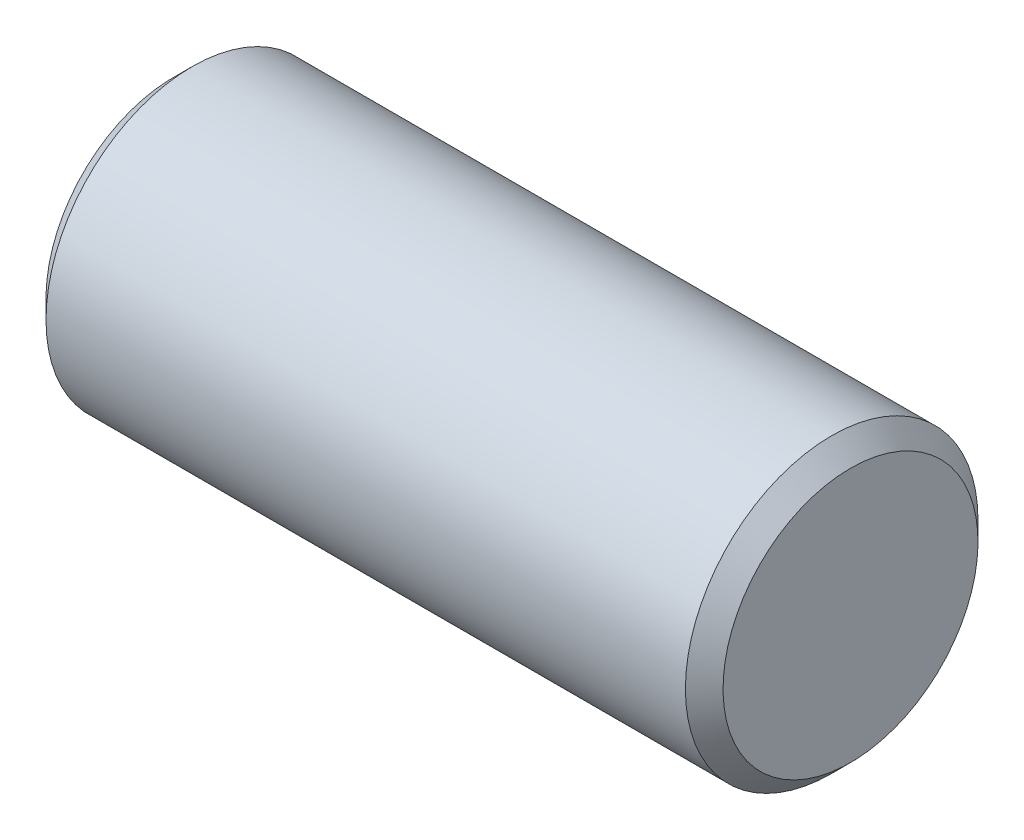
ISO-10303-21;
HEADER;
FILE_DESCRIPTION(('STEP AP214'),'2;1');
FILE_NAME('part.step','',(''),(''),'','','');
FILE_SCHEMA(('AUTOMOTIVE_DESIGN { 1 0 10303 214 1 1 1 1 }'));
ENDSEC;
DATA;
#1=APPLICATION_CONTEXT('core data for automotive mechanical design processes');
#2=APPLICATION_PROTOCOL_DEFINITION('international standard','automotive_design',2000,#1);
#3=PRODUCT_CONTEXT('',#1,'mechanical');
#4=PRODUCT('Part','Part','',(#3));
#5=PRODUCT_RELATED_PRODUCT_CATEGORY('part','',(#4));
#6=PRODUCT_DEFINITION_FORMATION('','',#4);
#7=PRODUCT_DEFINITION_CONTEXT('part definition',#1,'design');
#8=PRODUCT_DEFINITION('design','',#6,#7);
#9=PRODUCT_DEFINITION_SHAPE('','',#8);
#10=(LENGTH_UNIT() NAMED_UNIT(*) SI_UNIT(.MILLI.,.METRE.));
#11=(NAMED_UNIT(*) PLANE_ANGLE_UNIT() SI_UNIT($,.RADIAN.));
#12=(NAMED_UNIT(*) SI_UNIT($,.STERADIAN.) SOLID_ANGLE_UNIT());
#13=UNCERTAINTY_MEASURE_WITH_UNIT(LENGTH_MEASURE(1.E-05),#10,'distance_accuracy_value','');
#14=(GEOMETRIC_REPRESENTATION_CONTEXT(3) GLOBAL_UNCERTAINTY_ASSIGNED_CONTEXT((#13)) GLOBAL_UNIT_ASSIGNED_CONTEXT((#10,
#11,#12)) REPRESENTATION_CONTEXT('',''));
#15=CARTESIAN_POINT('',(0.,0.,0.));
#16=DIRECTION('',(0.,0.,1.));
#17=DIRECTION('',(1.,0.,0.));
#18=AXIS2_PLACEMENT_3D('',#15,#16,#17);
#19=CARTESIAN_POINT('',(-4.57,0.,0.));
#20=DIRECTION('',(-1.,0.,0.));
#21=DIRECTION('',(0.,-1.,0.));
#22=AXIS2_PLACEMENT_3D('',#19,#20,#21);
#23=PLANE('',#22);
#24=CARTESIAN_POINT('',(-4.57,0.,0.));
#25=DIRECTION('',(-1.,0.,0.));
#26=DIRECTION('',(0.,-1.,0.));
#27=AXIS2_PLACEMENT_3D('',#24,#25,#26);
#28=CIRCLE('',#27,1.721);
#29=CARTESIAN_POINT('',(-4.57,-1.72100000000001,0.));
#30=VERTEX_POINT('',#29);
#31=EDGE_CURVE('E10',#30,#30,#28,.T.);
#32=ORIENTED_EDGE('',*,*,#31,.T.);
#33=EDGE_LOOP('',(#32));
#34=FACE_BOUND('',#33,.T.);
#35=ADVANCED_FACE('F28',(#34),#23,.T.);
#36=CARTESIAN_POINT('',(4.57,0.,0.));
#37=DIRECTION('',(1.,0.,0.));
#38=DIRECTION('',(0.,1.,0.));
#39=AXIS2_PLACEMENT_3D('',#36,#37,#38);
#40=CYLINDRICAL_SURFACE('',#39,1.975);
#41=CARTESIAN_POINT('',(4.316,0.,0.));
#42=DIRECTION('',(1.,0.,0.));
#43=DIRECTION('',(0.,1.,0.));
#44=AXIS2_PLACEMENT_3D('',#41,#42,#43);
#45=CIRCLE('',#44,1.975);
#46=CARTESIAN_POINT('',(4.31600000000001,1.97499999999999,0.));
#47=VERTEX_POINT('',#46);
#48=EDGE_CURVE('E35',#47,#47,#45,.F.);
#49=ORIENTED_EDGE('',*,*,#48,.T.);
#50=EDGE_LOOP('',(#49));
#51=FACE_BOUND('',#50,.T.);
#52=CARTESIAN_POINT('',(-4.316,0.,0.));
#53=DIRECTION('',(-1.,0.,0.));
#54=DIRECTION('',(0.,-1.,0.));
#55=AXIS2_PLACEMENT_3D('',#52,#53,#54);
#56=CIRCLE('',#55,1.975);
#57=CARTESIAN_POINT('',(-4.31600000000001,-1.975,0.));
#58=VERTEX_POINT('',#57);
#59=EDGE_CURVE('E39',#58,#58,#56,.F.);
#60=ORIENTED_EDGE('',*,*,#59,.T.);
#61=EDGE_LOOP('',(#60));
#62=FACE_BOUND('',#61,.T.);
#63=ADVANCED_FACE('F59',(#51,#62),#40,.T.);
#64=CARTESIAN_POINT('',(4.57,0.,0.));
#65=DIRECTION('',(1.,0.,0.));
#66=DIRECTION('',(0.,1.,0.));
#67=AXIS2_PLACEMENT_3D('',#64,#65,#66);
#68=PLANE('',#67);
#69=CARTESIAN_POINT('',(4.57,0.,0.));
#70=DIRECTION('',(1.,0.,0.));
#71=DIRECTION('',(0.,1.,0.));
#72=AXIS2_PLACEMENT_3D('',#69,#70,#71);
#73=CIRCLE('',#72,1.72100000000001);
#74=CARTESIAN_POINT('',(4.57,1.721,0.));
#75=VERTEX_POINT('',#74);
#76=EDGE_CURVE('E43',#75,#75,#73,.T.);
#77=ORIENTED_EDGE('',*,*,#76,.T.);
#78=EDGE_LOOP('',(#77));
#79=FACE_BOUND('',#78,.T.);
#80=ADVANCED_FACE('F49',(#79),#68,.T.);
#81=CARTESIAN_POINT('',(4.57,0.,0.));
#82=DIRECTION('',(-1.,0.,0.));
#83=DIRECTION('',(0.,-1.,0.));
#84=AXIS2_PLACEMENT_3D('',#81,#82,#83);
#85=CONICAL_SURFACE('',#84,1.72100000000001,0.785398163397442);
#86=ORIENTED_EDGE('',*,*,#48,.F.);
#87=EDGE_LOOP('',(#86));
#88=FACE_BOUND('',#87,.T.);
#89=ORIENTED_EDGE('',*,*,#76,.F.);
#90=EDGE_LOOP('',(#89));
#91=FACE_BOUND('',#90,.T.);
#92=ADVANCED_FACE('F51',(#88,#91),#85,.T.);
#93=CARTESIAN_POINT('',(-4.316,0.,0.));
#94=DIRECTION('',(1.,0.,0.));
#95=DIRECTION('',(0.,1.,0.));
#96=AXIS2_PLACEMENT_3D('',#93,#94,#95);
#97=CONICAL_SURFACE('',#96,1.975,0.785398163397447);
#98=ORIENTED_EDGE('',*,*,#31,.F.);
#99=EDGE_LOOP('',(#98));
#100=FACE_BOUND('',#99,.T.);
#101=ORIENTED_EDGE('',*,*,#59,.F.);
#102=EDGE_LOOP('',(#101));
#103=FACE_BOUND('',#102,.T.);
#104=ADVANCED_FACE('F30',(#100,#103),#97,.T.);
#105=CLOSED_SHELL('',(#35,#63,#80,#92,#104));
#106=MANIFOLD_SOLID_BREP('B2',#105);
#107=ADVANCED_BREP_SHAPE_REPRESENTATION('',(#18,#106),#14);
#108=SHAPE_DEFINITION_REPRESENTATION(#9,#107);
ENDSEC;
END-ISO-10303-21;
